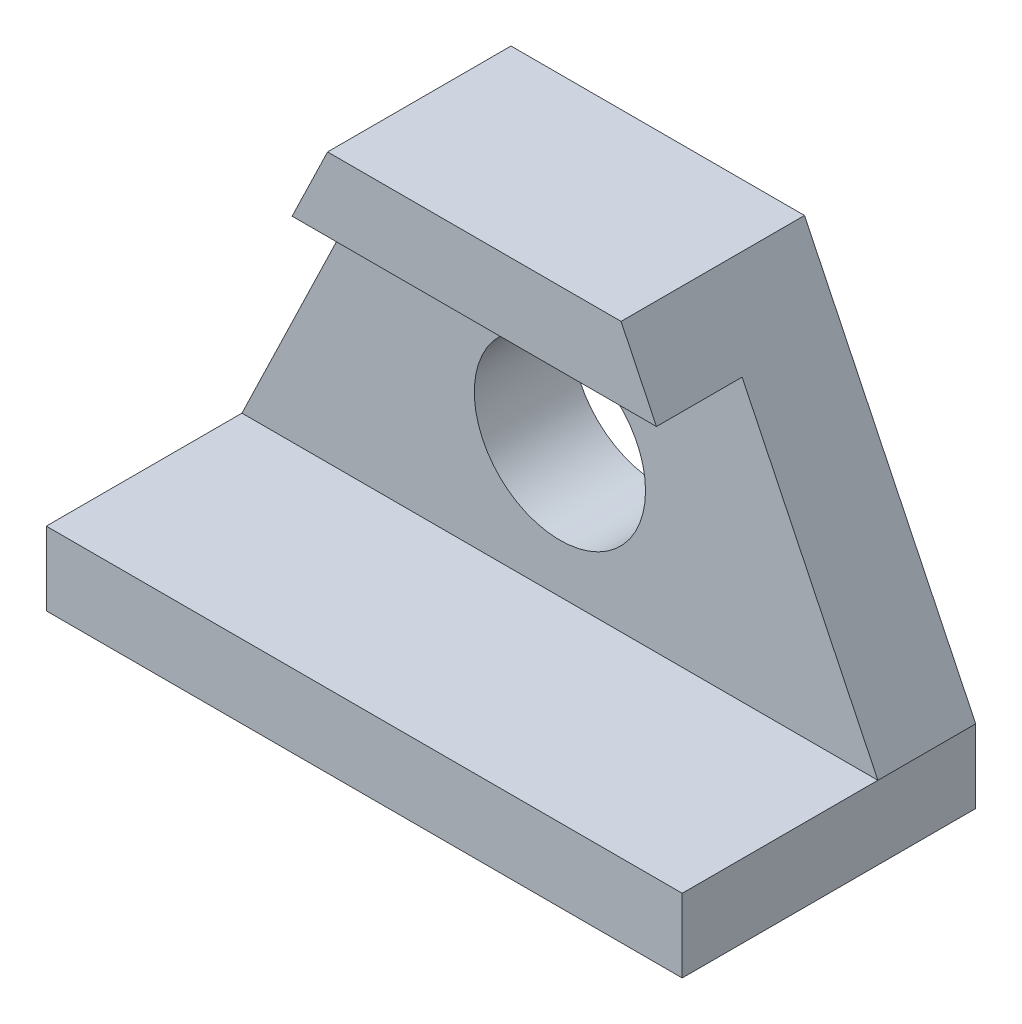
from build123d import *

# Parameters (mm, degrees)
EXTRUDE_1_DEPTH     = 26
CUT_EXTRUDE_1_DEPTH = 52
SKETCH_3_R          = 7
CUT_EXTRUDE_2_DEPTH = 47.443514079


with BuildPart() as part:
    # Sketch 1 → Extrude 1 (new, symmetric)
    with BuildSketch(Plane(origin=(0, 0, 0), x_dir=(0, 0, -1), z_dir=(1, 0, 0))):
        Polygon((0, 0), (0, 35), (-15, 35), (-15, 29), (-8, 29), (-8, 6), (-24, 6), (-24, 0), align=None)
    extrude(amount=EXTRUDE_1_DEPTH, both=True)

    # Sketch 2 → Cut-Extrude 1 (cut)
    with BuildSketch(Plane(origin=(0, 0, 0), x_dir=(-1, 0, 0), z_dir=(0, 0, -1))):
        Polygon((26, 6), (12, 35), (26, 35), align=None)
    cut_extrude_1 = extrude(amount=-CUT_EXTRUDE_1_DEPTH, mode=Mode.SUBTRACT)

    # Mirror 1: Cut-Extrude 1 across plane
    add(cut_extrude_1.mirror(Plane(origin=(0, 0, 0), x_dir=(0, 0, 1), z_dir=(1, 0, 0))), mode=Mode.SUBTRACT)

    # Sketch 3 → Cut-Extrude 2 (cut, through all)
    with BuildSketch(Plane.XY.offset(8)):
        with Locations((0, 17)):
            Circle(SKETCH_3_R)
    extrude(amount=-CUT_EXTRUDE_2_DEPTH, mode=Mode.SUBTRACT)


solid = part.part
